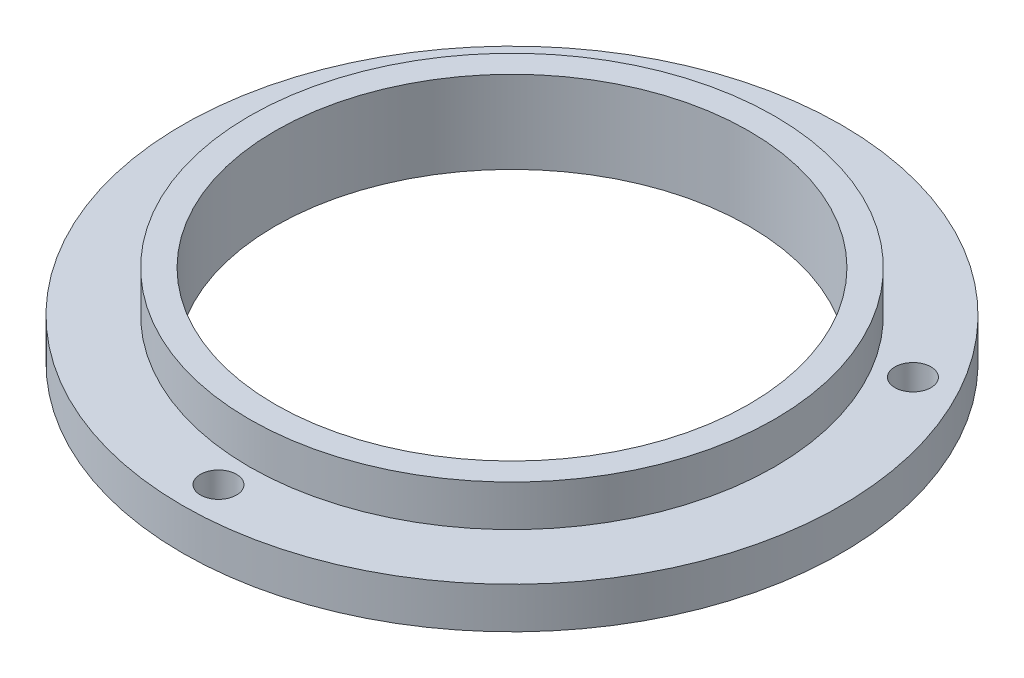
from build123d import *

# Parameters (mm, degrees)
SCHIZZO3_R               = 1.75
TAGLIO_ESTRUSIONE2_DEPTH = 46.956501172


with BuildPart() as part:
    # Schizzo1 → Rivoluzione1 (revolve)
    with BuildSketch(Plane.XY, mode=Mode.PRIVATE) as rivoluzione1_sk:
        Polygon((23, -4), (32, -4), (32, 0), (25.5, 0), (25.5, 4), (23, 4), align=None)
    revolve(rivoluzione1_sk.sketch.rotate(Axis((0, 65.172331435, 0), (0, -1, 0)), 90), axis=Axis((0, 65.172331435, 0), (0, -1, 0)))

    # Schizzo3 → Taglio-Estrusione2 (cut, through all)
    with BuildSketch(Plane(origin=(0, -4, 0), x_dir=(-1, 0, 0), z_dir=(0, -1, 0))):
        with Locations(Location((0, -28.5, 0), (0, 0, 90))):
            Circle(SCHIZZO3_R)
        with Locations(Location((-24.681724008, 14.25, 0), (0, 0, 90))):
            Circle(SCHIZZO3_R)
        with Locations(Location((24.681724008, 14.25, 0), (0, 0, 90))):
            Circle(SCHIZZO3_R)
    extrude(amount=-TAGLIO_ESTRUSIONE2_DEPTH, mode=Mode.SUBTRACT)


solid = part.part
